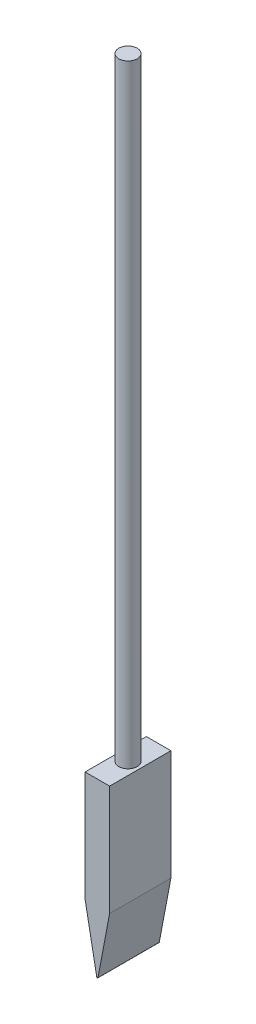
from build123d import *

# Parameters (mm, degrees)
EXTRUDE1_DEPTH = 10
SKETCH2_R      = 1.5
EXTRUDE2_DEPTH = 100


with BuildPart() as part:
    # Sketch1 → Extrude1 (new body)
    with BuildSketch(Plane.XY):
        with BuildLine():
            Line((-2, 10), (-0.098243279, -0.018648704))
            ThreePointArc((-0.098243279, -0.018648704), (0, -0.09999758), (0.098243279, -0.018648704))
            Line((0.098243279, -0.018648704), (2, 10))
            Line((2, 10), (2, 28))
            Line((2, 28), (-2, 28))
            Line((-2, 28), (-2, 10))
        make_face()
    extrude(amount=EXTRUDE1_DEPTH)

    # Sketch2 → Extrude2 (add)
    with BuildSketch(Plane(origin=(0, 28, 0), x_dir=(-1, 0, 0), z_dir=(0, 1, 0))):
        with Locations(Location((0, 5, 0), (0, 0, 270))):
            Circle(SKETCH2_R)
    extrude(amount=EXTRUDE2_DEPTH)


solid = part.part
